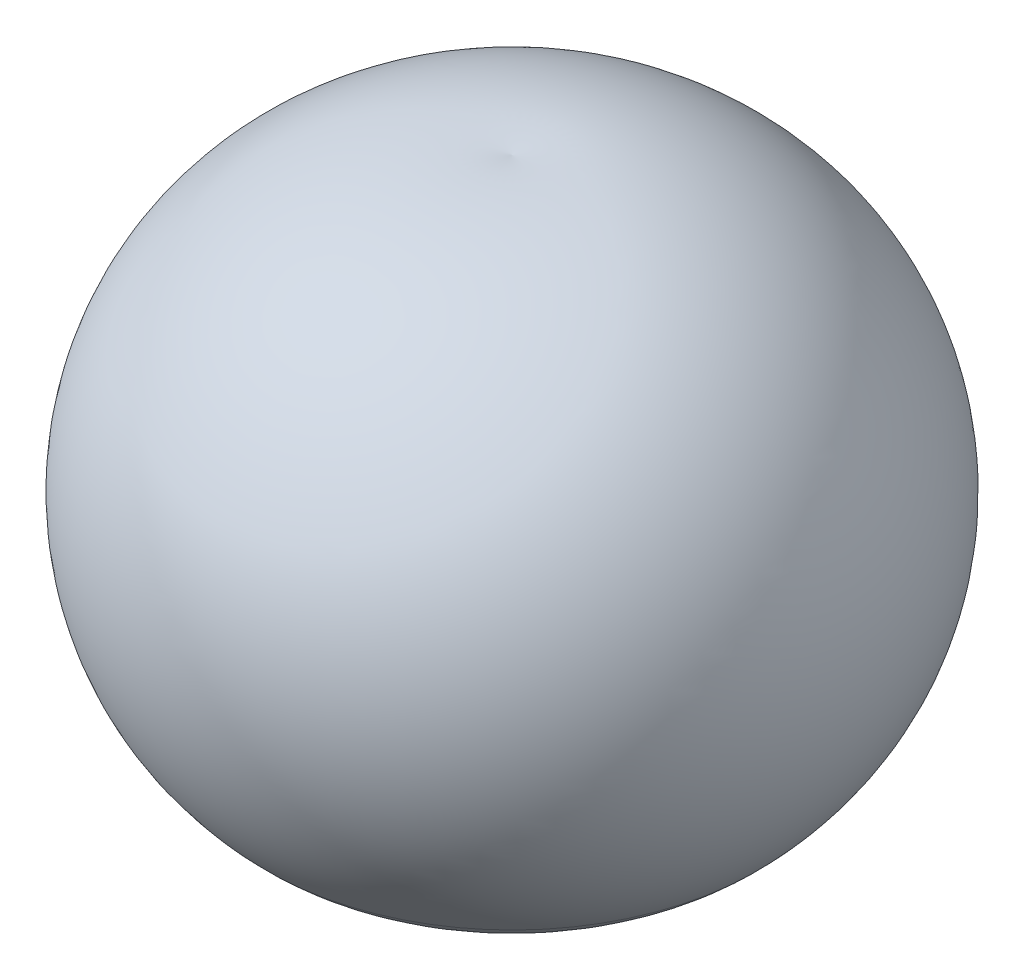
from build123d import *


with BuildPart() as part:
    # Sketch 2 → Revolve 1 (revolve)
    with BuildSketch(Plane(origin=(0, 0, 0), x_dir=(0, 0, -1), z_dir=(1, 0, 0))):
        with BuildLine():
            Line((0, -659.750258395), (0, 267.191986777))
            ThreePointArc((0, 267.191986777), (-548.026682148, 371.844444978), (-351.044486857, 893.843866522))
            ThreePointArc((-351.044486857, 893.843866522), (-210.764648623, 1159.086281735), (0, 1372.651809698))
            Line((0, 1372.651809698), (0, 2416.003014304))
            ThreePointArc((0, 2416.003014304), (-1919.652211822, 1374.586352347), (-1559.448616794, -779.448616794))
            ThreePointArc((-1559.448616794, -779.448616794), (-752.20357185, -1078.143824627), (0, -659.750258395))
        make_face()
    revolve(axis=Axis((0, -659.750258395, 0), (0, 1, 0)))


solid = part.part
